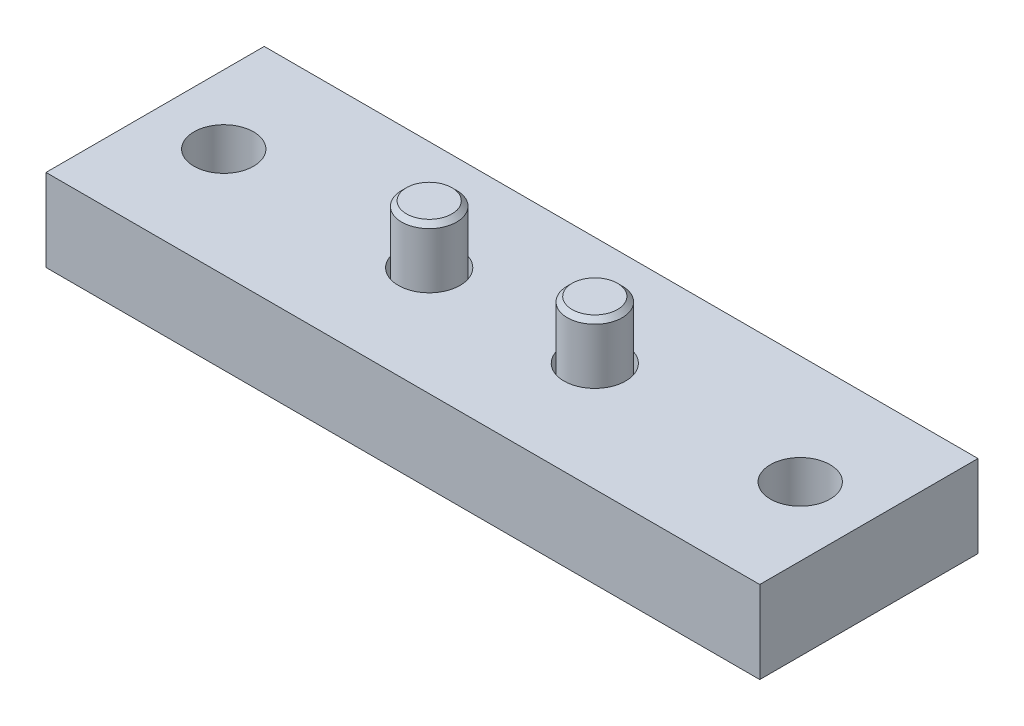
ISO-10303-21;
HEADER;
FILE_DESCRIPTION(('STEP AP214'),'2;1');
FILE_NAME('part.step','',(''),(''),'','','');
FILE_SCHEMA(('AUTOMOTIVE_DESIGN { 1 0 10303 214 1 1 1 1 }'));
ENDSEC;
DATA;
#1=APPLICATION_CONTEXT('core data for automotive mechanical design processes');
#2=APPLICATION_PROTOCOL_DEFINITION('international standard','automotive_design',2000,#1);
#3=PRODUCT_CONTEXT('',#1,'mechanical');
#4=PRODUCT('Part','Part','',(#3));
#5=PRODUCT_RELATED_PRODUCT_CATEGORY('part','',(#4));
#6=PRODUCT_DEFINITION_FORMATION('','',#4);
#7=PRODUCT_DEFINITION_CONTEXT('part definition',#1,'design');
#8=PRODUCT_DEFINITION('design','',#6,#7);
#9=PRODUCT_DEFINITION_SHAPE('','',#8);
#10=(LENGTH_UNIT() NAMED_UNIT(*) SI_UNIT(.MILLI.,.METRE.));
#11=(NAMED_UNIT(*) PLANE_ANGLE_UNIT() SI_UNIT($,.RADIAN.));
#12=(NAMED_UNIT(*) SI_UNIT($,.STERADIAN.) SOLID_ANGLE_UNIT());
#13=UNCERTAINTY_MEASURE_WITH_UNIT(LENGTH_MEASURE(1.E-05),#10,'distance_accuracy_value','');
#14=(GEOMETRIC_REPRESENTATION_CONTEXT(3) GLOBAL_UNCERTAINTY_ASSIGNED_CONTEXT((#13)) GLOBAL_UNIT_ASSIGNED_CONTEXT((#10,
#11,#12)) REPRESENTATION_CONTEXT('',''));
#15=CARTESIAN_POINT('',(0.,0.,0.));
#16=DIRECTION('',(0.,0.,1.));
#17=DIRECTION('',(1.,0.,0.));
#18=AXIS2_PLACEMENT_3D('',#15,#16,#17);
#19=CARTESIAN_POINT('',(8.7555,8.438,0.));
#20=DIRECTION('',(0.,1.,0.));
#21=DIRECTION('',(0.,0.,-1.));
#22=AXIS2_PLACEMENT_3D('',#19,#20,#21);
#23=PLANE('',#22);
#24=CARTESIAN_POINT('',(12.065,8.438,0.));
#25=DIRECTION('',(0.,-1.,0.));
#26=DIRECTION('',(0.,0.,1.));
#27=AXIS2_PLACEMENT_3D('',#24,#25,#26);
#28=CIRCLE('',#27,3.3095);
#29=CARTESIAN_POINT('',(12.065,8.438,3.3095));
#30=VERTEX_POINT('',#29);
#31=EDGE_CURVE('E915',#30,#30,#28,.T.);
#32=ORIENTED_EDGE('',*,*,#31,.F.);
#33=EDGE_LOOP('',(#32));
#34=FACE_BOUND('',#33,.T.);
#35=ADVANCED_FACE('F16',(#34),#23,.T.);
#36=CARTESIAN_POINT('',(12.065,8.438,0.));
#37=DIRECTION('',(0.,-1.,0.));
#38=DIRECTION('',(0.,0.,1.));
#39=AXIS2_PLACEMENT_3D('',#36,#37,#38);
#40=CONICAL_SURFACE('',#39,3.3095,0.785398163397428);
#41=CARTESIAN_POINT('',(12.065,7.7475,0.));
#42=DIRECTION('',(0.,-1.,0.));
#43=DIRECTION('',(0.,0.,1.));
#44=AXIS2_PLACEMENT_3D('',#41,#42,#43);
#45=CIRCLE('',#44,4.);
#46=CARTESIAN_POINT('',(12.065,7.7475,4.));
#47=VERTEX_POINT('',#46);
#48=EDGE_CURVE('E912',#47,#47,#45,.T.);
#49=ORIENTED_EDGE('',*,*,#48,.F.);
#50=EDGE_LOOP('',(#49));
#51=FACE_BOUND('',#50,.T.);
#52=ORIENTED_EDGE('',*,*,#31,.T.);
#53=EDGE_LOOP('',(#52));
#54=FACE_BOUND('',#53,.T.);
#55=ADVANCED_FACE('F328',(#51,#54),#40,.T.);
#56=CARTESIAN_POINT('',(12.065,-11.562,0.));
#57=DIRECTION('',(0.,-1.,0.));
#58=DIRECTION('',(0.,0.,1.));
#59=AXIS2_PLACEMENT_3D('',#56,#57,#58);
#60=CYLINDRICAL_SURFACE('',#59,4.);
#61=CARTESIAN_POINT('',(12.065,-6.43631457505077,0.));
#62=DIRECTION('',(0.,-1.,0.));
#63=DIRECTION('',(0.,0.,1.));
#64=AXIS2_PLACEMENT_3D('',#61,#62,#63);
#65=CIRCLE('',#64,4.);
#66=CARTESIAN_POINT('',(12.065,-6.43631457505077,4.));
#67=VERTEX_POINT('',#66);
#68=EDGE_CURVE('E26',#67,#67,#65,.F.);
#69=ORIENTED_EDGE('',*,*,#68,.T.);
#70=EDGE_LOOP('',(#69));
#71=FACE_BOUND('',#70,.T.);
#72=ORIENTED_EDGE('',*,*,#48,.T.);
#73=EDGE_LOOP('',(#72));
#74=FACE_BOUND('',#73,.T.);
#75=ADVANCED_FACE('F335',(#71,#74),#60,.T.);
#76=CARTESIAN_POINT('',(12.065,-6.43631457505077,0.));
#77=DIRECTION('',(0.,-1.,0.));
#78=DIRECTION('',(0.,0.,1.));
#79=AXIS2_PLACEMENT_3D('',#76,#77,#78);
#80=TOROIDAL_SURFACE('',#79,4.4,0.4);
#81=ORIENTED_EDGE('',*,*,#68,.F.);
#82=EDGE_LOOP('',(#81));
#83=FACE_BOUND('',#82,.T.);
#84=CARTESIAN_POINT('',(12.065,-6.71915728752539,0.));
#85=DIRECTION('',(0.,-1.,0.));
#86=DIRECTION('',(0.,0.,1.));
#87=AXIS2_PLACEMENT_3D('',#84,#85,#86);
#88=CIRCLE('',#87,4.11715728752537);
#89=CARTESIAN_POINT('',(12.065,-6.71915728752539,4.11715728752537));
#90=VERTEX_POINT('',#89);
#91=EDGE_CURVE('E903',#90,#90,#88,.T.);
#92=ORIENTED_EDGE('',*,*,#91,.F.);
#93=EDGE_LOOP('',(#92));
#94=FACE_BOUND('',#93,.T.);
#95=ADVANCED_FACE('F340',(#83,#94),#80,.F.);
#96=CARTESIAN_POINT('',(12.065,-10.352,0.));
#97=DIRECTION('',(0.,-1.,0.));
#98=DIRECTION('',(0.,0.,1.));
#99=AXIS2_PLACEMENT_3D('',#96,#97,#98);
#100=CONICAL_SURFACE('',#99,7.75,0.78539816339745);
#101=ORIENTED_EDGE('',*,*,#91,.T.);
#102=EDGE_LOOP('',(#101));
#103=FACE_BOUND('',#102,.T.);
#104=CARTESIAN_POINT('',(12.065,-7.097,0.));
#105=DIRECTION('',(0.,-1.,0.));
#106=DIRECTION('',(0.,0.,-1.));
#107=AXIS2_PLACEMENT_3D('',#104,#105,#106);
#108=CIRCLE('',#107,4.495);
#109=CARTESIAN_POINT('',(12.065,-7.097,-4.495));
#110=VERTEX_POINT('',#109);
#111=EDGE_CURVE('E10',#110,#110,#108,.F.);
#112=ORIENTED_EDGE('',*,*,#111,.T.);
#113=EDGE_LOOP('',(#112));
#114=FACE_BOUND('',#113,.T.);
#115=ADVANCED_FACE('F346',(#103,#114),#100,.T.);
#116=CARTESIAN_POINT('',(12.065,-11.562,0.));
#117=DIRECTION('',(0.,-1.,0.));
#118=DIRECTION('',(0.,0.,1.));
#119=AXIS2_PLACEMENT_3D('',#116,#117,#118);
#120=PLANE('',#119);
#121=CARTESIAN_POINT('',(12.065,-11.562,0.));
#122=DIRECTION('',(0.,-1.,0.));
#123=DIRECTION('',(0.,0.,1.));
#124=AXIS2_PLACEMENT_3D('',#121,#122,#123);
#125=CIRCLE('',#124,7.75);
#126=CARTESIAN_POINT('',(12.065,-11.562,7.75));
#127=VERTEX_POINT('',#126);
#128=EDGE_CURVE('E904',#127,#127,#125,.T.);
#129=ORIENTED_EDGE('',*,*,#128,.T.);
#130=EDGE_LOOP('',(#129));
#131=FACE_BOUND('',#130,.T.);
#132=DIRECTION('',(0.5,0.,-0.866025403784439));
#133=VECTOR('',#132,1.);
#134=CARTESIAN_POINT('',(13.5083756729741,-11.562,2.5));
#135=LINE('',#134,#133);
#136=CARTESIAN_POINT('',(13.5083756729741,-11.562,2.5));
#137=VERTEX_POINT('',#136);
#138=CARTESIAN_POINT('',(14.9517513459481,-11.562,0.));
#139=VERTEX_POINT('',#138);
#140=EDGE_CURVE('E962',#137,#139,#135,.T.);
#141=ORIENTED_EDGE('',*,*,#140,.T.);
#142=DIRECTION('',(-0.5,0.,-0.866025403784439));
#143=VECTOR('',#142,1.);
#144=CARTESIAN_POINT('',(14.9517513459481,-11.562,0.));
#145=LINE('',#144,#143);
#146=CARTESIAN_POINT('',(13.5083756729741,-11.562,-2.5));
#147=VERTEX_POINT('',#146);
#148=EDGE_CURVE('E35',#139,#147,#145,.T.);
#149=ORIENTED_EDGE('',*,*,#148,.T.);
#150=DIRECTION('',(-1.,0.,0.));
#151=VECTOR('',#150,1.);
#152=CARTESIAN_POINT('',(13.5083756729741,-11.562,-2.5));
#153=LINE('',#152,#151);
#154=CARTESIAN_POINT('',(10.6216243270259,-11.562,-2.5));
#155=VERTEX_POINT('',#154);
#156=EDGE_CURVE('E974',#147,#155,#153,.T.);
#157=ORIENTED_EDGE('',*,*,#156,.T.);
#158=DIRECTION('',(-0.5,0.,0.866025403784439));
#159=VECTOR('',#158,1.);
#160=CARTESIAN_POINT('',(10.6216243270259,-11.562,-2.5));
#161=LINE('',#160,#159);
#162=CARTESIAN_POINT('',(9.17824865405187,-11.562,0.));
#163=VERTEX_POINT('',#162);
#164=EDGE_CURVE('E971',#155,#163,#161,.T.);
#165=ORIENTED_EDGE('',*,*,#164,.T.);
#166=DIRECTION('',(0.5,0.,0.866025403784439));
#167=VECTOR('',#166,1.);
#168=CARTESIAN_POINT('',(9.17824865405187,-11.562,0.));
#169=LINE('',#168,#167);
#170=CARTESIAN_POINT('',(10.6216243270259,-11.562,2.5));
#171=VERTEX_POINT('',#170);
#172=EDGE_CURVE('E968',#163,#171,#169,.T.);
#173=ORIENTED_EDGE('',*,*,#172,.T.);
#174=DIRECTION('',(1.,0.,0.));
#175=VECTOR('',#174,1.);
#176=CARTESIAN_POINT('',(10.6216243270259,-11.562,2.5));
#177=LINE('',#176,#175);
#178=EDGE_CURVE('E965',#171,#137,#177,.T.);
#179=ORIENTED_EDGE('',*,*,#178,.T.);
#180=EDGE_LOOP('',(#141,#149,#157,#165,#173,#179));
#181=FACE_BOUND('',#180,.T.);
#182=ADVANCED_FACE('F349',(#131,#181),#120,.T.);
#183=CARTESIAN_POINT('',(12.065,-11.562,0.));
#184=DIRECTION('',(0.,-1.,0.));
#185=DIRECTION('',(0.,0.,1.));
#186=AXIS2_PLACEMENT_3D('',#183,#184,#185);
#187=CYLINDRICAL_SURFACE('',#186,7.75);
#188=CARTESIAN_POINT('',(12.065,-10.352,0.));
#189=DIRECTION('',(0.,-1.,0.));
#190=DIRECTION('',(0.,0.,1.));
#191=AXIS2_PLACEMENT_3D('',#188,#189,#190);
#192=CIRCLE('',#191,7.75);
#193=CARTESIAN_POINT('',(12.065,-10.352,7.75));
#194=VERTEX_POINT('',#193);
#195=EDGE_CURVE('E907',#194,#194,#192,.T.);
#196=ORIENTED_EDGE('',*,*,#195,.T.);
#197=EDGE_LOOP('',(#196));
#198=FACE_BOUND('',#197,.T.);
#199=ORIENTED_EDGE('',*,*,#128,.F.);
#200=EDGE_LOOP('',(#199));
#201=FACE_BOUND('',#200,.T.);
#202=ADVANCED_FACE('F352',(#198,#201),#187,.T.);
#203=CARTESIAN_POINT('',(14.9517513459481,-8.562,0.));
#204=DIRECTION('',(-0.866025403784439,0.,0.5));
#205=DIRECTION('',(0.5,0.,0.866025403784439));
#206=AXIS2_PLACEMENT_3D('',#203,#204,#205);
#207=PLANE('',#206);
#208=ORIENTED_EDGE('',*,*,#148,.F.);
#209=DIRECTION('',(0.,-1.,0.));
#210=VECTOR('',#209,1.);
#211=CARTESIAN_POINT('',(14.9517513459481,-8.562,0.));
#212=LINE('',#211,#210);
#213=CARTESIAN_POINT('',(14.9517513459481,-8.562,0.));
#214=VERTEX_POINT('',#213);
#215=EDGE_CURVE('E937',#214,#139,#212,.T.);
#216=ORIENTED_EDGE('',*,*,#215,.F.);
#217=DIRECTION('',(-0.5,0.,-0.866025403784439));
#218=VECTOR('',#217,1.);
#219=CARTESIAN_POINT('',(14.9517513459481,-8.562,0.));
#220=LINE('',#219,#218);
#221=CARTESIAN_POINT('',(14.2300635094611,-8.562,-1.25));
#222=VERTEX_POINT('',#221);
#223=EDGE_CURVE('E958',#214,#222,#220,.T.);
#224=ORIENTED_EDGE('',*,*,#223,.T.);
#225=CARTESIAN_POINT('',(13.5083756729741,-8.562,-2.5));
#226=VERTEX_POINT('',#225);
#227=EDGE_CURVE('E961',#222,#226,#220,.T.);
#228=ORIENTED_EDGE('',*,*,#227,.T.);
#229=DIRECTION('',(0.,-1.,0.));
#230=VECTOR('',#229,1.);
#231=CARTESIAN_POINT('',(13.5083756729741,-8.562,-2.5));
#232=LINE('',#231,#230);
#233=EDGE_CURVE('E923',#226,#147,#232,.T.);
#234=ORIENTED_EDGE('',*,*,#233,.T.);
#235=EDGE_LOOP('',(#208,#216,#224,#228,#234));
#236=FACE_BOUND('',#235,.T.);
#237=ADVANCED_FACE('F355',(#236),#207,.T.);
#238=CARTESIAN_POINT('',(13.5083756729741,-8.562,-2.5));
#239=DIRECTION('',(0.,0.,1.));
#240=DIRECTION('',(1.,0.,0.));
#241=AXIS2_PLACEMENT_3D('',#238,#239,#240);
#242=PLANE('',#241);
#243=ORIENTED_EDGE('',*,*,#156,.F.);
#244=ORIENTED_EDGE('',*,*,#233,.F.);
#245=DIRECTION('',(-1.,0.,0.));
#246=VECTOR('',#245,1.);
#247=CARTESIAN_POINT('',(13.5083756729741,-8.562,-2.5));
#248=LINE('',#247,#246);
#249=CARTESIAN_POINT('',(12.065,-8.562,-2.5));
#250=VERTEX_POINT('',#249);
#251=EDGE_CURVE('E955',#226,#250,#248,.T.);
#252=ORIENTED_EDGE('',*,*,#251,.T.);
#253=CARTESIAN_POINT('',(10.6216243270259,-8.562,-2.5));
#254=VERTEX_POINT('',#253);
#255=EDGE_CURVE('E957',#250,#254,#248,.T.);
#256=ORIENTED_EDGE('',*,*,#255,.T.);
#257=DIRECTION('',(0.,-1.,0.));
#258=VECTOR('',#257,1.);
#259=CARTESIAN_POINT('',(10.6216243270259,-8.562,-2.5));
#260=LINE('',#259,#258);
#261=EDGE_CURVE('E925',#254,#155,#260,.T.);
#262=ORIENTED_EDGE('',*,*,#261,.T.);
#263=EDGE_LOOP('',(#243,#244,#252,#256,#262));
#264=FACE_BOUND('',#263,.T.);
#265=ADVANCED_FACE('F778',(#264),#242,.T.);
#266=CARTESIAN_POINT('',(10.6216243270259,-8.562,-2.5));
#267=DIRECTION('',(0.866025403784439,0.,0.5));
#268=DIRECTION('',(0.5,0.,-0.866025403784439));
#269=AXIS2_PLACEMENT_3D('',#266,#267,#268);
#270=PLANE('',#269);
#271=ORIENTED_EDGE('',*,*,#164,.F.);
#272=ORIENTED_EDGE('',*,*,#261,.F.);
#273=DIRECTION('',(-0.5,0.,0.866025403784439));
#274=VECTOR('',#273,1.);
#275=CARTESIAN_POINT('',(10.6216243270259,-8.562,-2.5));
#276=LINE('',#275,#274);
#277=CARTESIAN_POINT('',(9.8999364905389,-8.562,-1.25));
#278=VERTEX_POINT('',#277);
#279=EDGE_CURVE('E951',#254,#278,#276,.T.);
#280=ORIENTED_EDGE('',*,*,#279,.T.);
#281=CARTESIAN_POINT('',(9.17824865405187,-8.562,0.));
#282=VERTEX_POINT('',#281);
#283=EDGE_CURVE('E954',#278,#282,#276,.T.);
#284=ORIENTED_EDGE('',*,*,#283,.T.);
#285=DIRECTION('',(0.,-1.,0.));
#286=VECTOR('',#285,1.);
#287=CARTESIAN_POINT('',(9.17824865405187,-8.562,0.));
#288=LINE('',#287,#286);
#289=EDGE_CURVE('E928',#282,#163,#288,.T.);
#290=ORIENTED_EDGE('',*,*,#289,.T.);
#291=EDGE_LOOP('',(#271,#272,#280,#284,#290));
#292=FACE_BOUND('',#291,.T.);
#293=ADVANCED_FACE('F768',(#292),#270,.T.);
#294=CARTESIAN_POINT('',(9.17824865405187,-8.562,0.));
#295=DIRECTION('',(0.866025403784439,0.,-0.5));
#296=DIRECTION('',(-0.5,0.,-0.866025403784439));
#297=AXIS2_PLACEMENT_3D('',#294,#295,#296);
#298=PLANE('',#297);
#299=ORIENTED_EDGE('',*,*,#172,.F.);
#300=ORIENTED_EDGE('',*,*,#289,.F.);
#301=DIRECTION('',(0.5,0.,0.866025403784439));
#302=VECTOR('',#301,1.);
#303=CARTESIAN_POINT('',(9.17824865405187,-8.562,0.));
#304=LINE('',#303,#302);
#305=CARTESIAN_POINT('',(9.8999364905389,-8.562,1.25));
#306=VERTEX_POINT('',#305);
#307=EDGE_CURVE('E947',#282,#306,#304,.T.);
#308=ORIENTED_EDGE('',*,*,#307,.T.);
#309=CARTESIAN_POINT('',(10.6216243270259,-8.562,2.5));
#310=VERTEX_POINT('',#309);
#311=EDGE_CURVE('E950',#306,#310,#304,.T.);
#312=ORIENTED_EDGE('',*,*,#311,.T.);
#313=DIRECTION('',(0.,-1.,0.));
#314=VECTOR('',#313,1.);
#315=CARTESIAN_POINT('',(10.6216243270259,-8.562,2.5));
#316=LINE('',#315,#314);
#317=EDGE_CURVE('E931',#310,#171,#316,.T.);
#318=ORIENTED_EDGE('',*,*,#317,.T.);
#319=EDGE_LOOP('',(#299,#300,#308,#312,#318));
#320=FACE_BOUND('',#319,.T.);
#321=ADVANCED_FACE('F758',(#320),#298,.T.);
#322=CARTESIAN_POINT('',(10.6216243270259,-8.562,2.5));
#323=DIRECTION('',(0.,0.,-1.));
#324=DIRECTION('',(0.,-1.,0.));
#325=AXIS2_PLACEMENT_3D('',#322,#323,#324);
#326=PLANE('',#325);
#327=ORIENTED_EDGE('',*,*,#178,.F.);
#328=ORIENTED_EDGE('',*,*,#317,.F.);
#329=DIRECTION('',(1.,0.,0.));
#330=VECTOR('',#329,1.);
#331=CARTESIAN_POINT('',(10.6216243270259,-8.562,2.5));
#332=LINE('',#331,#330);
#333=CARTESIAN_POINT('',(12.065,-8.562,2.5));
#334=VERTEX_POINT('',#333);
#335=EDGE_CURVE('E943',#310,#334,#332,.T.);
#336=ORIENTED_EDGE('',*,*,#335,.T.);
#337=CARTESIAN_POINT('',(13.5083756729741,-8.562,2.5));
#338=VERTEX_POINT('',#337);
#339=EDGE_CURVE('E946',#334,#338,#332,.T.);
#340=ORIENTED_EDGE('',*,*,#339,.T.);
#341=DIRECTION('',(0.,-1.,0.));
#342=VECTOR('',#341,1.);
#343=CARTESIAN_POINT('',(13.5083756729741,-8.562,2.5));
#344=LINE('',#343,#342);
#345=EDGE_CURVE('E934',#338,#137,#344,.T.);
#346=ORIENTED_EDGE('',*,*,#345,.T.);
#347=EDGE_LOOP('',(#327,#328,#336,#340,#346));
#348=FACE_BOUND('',#347,.T.);
#349=ADVANCED_FACE('F748',(#348),#326,.T.);
#350=CARTESIAN_POINT('',(13.5083756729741,-8.562,2.5));
#351=DIRECTION('',(-0.866025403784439,0.,-0.5));
#352=DIRECTION('',(-0.5,0.,0.866025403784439));
#353=AXIS2_PLACEMENT_3D('',#350,#351,#352);
#354=PLANE('',#353);
#355=ORIENTED_EDGE('',*,*,#140,.F.);
#356=ORIENTED_EDGE('',*,*,#345,.F.);
#357=DIRECTION('',(0.5,0.,-0.866025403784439));
#358=VECTOR('',#357,1.);
#359=CARTESIAN_POINT('',(13.5083756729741,-8.562,2.5));
#360=LINE('',#359,#358);
#361=CARTESIAN_POINT('',(14.2300635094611,-8.562,1.25));
#362=VERTEX_POINT('',#361);
#363=EDGE_CURVE('E939',#338,#362,#360,.T.);
#364=ORIENTED_EDGE('',*,*,#363,.T.);
#365=EDGE_CURVE('E942',#362,#214,#360,.T.);
#366=ORIENTED_EDGE('',*,*,#365,.T.);
#367=ORIENTED_EDGE('',*,*,#215,.T.);
#368=EDGE_LOOP('',(#355,#356,#364,#366,#367));
#369=FACE_BOUND('',#368,.T.);
#370=ADVANCED_FACE('F739',(#369),#354,.T.);
#371=CARTESIAN_POINT('',(13.5083756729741,-8.562,-2.5));
#372=DIRECTION('',(0.,1.,0.));
#373=DIRECTION('',(0.,0.,-1.));
#374=AXIS2_PLACEMENT_3D('',#371,#372,#373);
#375=PLANE('',#374);
#376=ORIENTED_EDGE('',*,*,#251,.F.);
#377=ORIENTED_EDGE('',*,*,#227,.F.);
#378=CARTESIAN_POINT('',(12.065,-8.562,0.));
#379=DIRECTION('',(0.,-1.,0.));
#380=DIRECTION('',(0.,0.,1.));
#381=AXIS2_PLACEMENT_3D('',#378,#379,#380);
#382=CIRCLE('',#381,2.5);
#383=EDGE_CURVE('E1049',#250,#222,#382,.T.);
#384=ORIENTED_EDGE('',*,*,#383,.F.);
#385=EDGE_LOOP('',(#376,#377,#384));
#386=FACE_BOUND('',#385,.T.);
#387=ADVANCED_FACE('F696',(#386),#375,.F.);
#388=ORIENTED_EDGE('',*,*,#223,.F.);
#389=ORIENTED_EDGE('',*,*,#365,.F.);
#390=EDGE_CURVE('E1050',#222,#362,#382,.T.);
#391=ORIENTED_EDGE('',*,*,#390,.F.);
#392=EDGE_LOOP('',(#388,#389,#391));
#393=FACE_BOUND('',#392,.T.);
#394=ADVANCED_FACE('F722',(#393),#375,.F.);
#395=ORIENTED_EDGE('',*,*,#363,.F.);
#396=ORIENTED_EDGE('',*,*,#339,.F.);
#397=EDGE_CURVE('E922',#362,#334,#382,.T.);
#398=ORIENTED_EDGE('',*,*,#397,.F.);
#399=EDGE_LOOP('',(#395,#396,#398));
#400=FACE_BOUND('',#399,.T.);
#401=ADVANCED_FACE('F713',(#400),#375,.F.);
#402=ORIENTED_EDGE('',*,*,#335,.F.);
#403=ORIENTED_EDGE('',*,*,#311,.F.);
#404=EDGE_CURVE('E918',#334,#306,#382,.T.);
#405=ORIENTED_EDGE('',*,*,#404,.F.);
#406=EDGE_LOOP('',(#402,#403,#405));
#407=FACE_BOUND('',#406,.T.);
#408=ADVANCED_FACE('F704',(#407),#375,.F.);
#409=ORIENTED_EDGE('',*,*,#307,.F.);
#410=ORIENTED_EDGE('',*,*,#283,.F.);
#411=EDGE_CURVE('E921',#306,#278,#382,.T.);
#412=ORIENTED_EDGE('',*,*,#411,.F.);
#413=EDGE_LOOP('',(#409,#410,#412));
#414=FACE_BOUND('',#413,.T.);
#415=ADVANCED_FACE('F693',(#414),#375,.F.);
#416=ORIENTED_EDGE('',*,*,#279,.F.);
#417=ORIENTED_EDGE('',*,*,#255,.F.);
#418=EDGE_CURVE('E1045',#278,#250,#382,.T.);
#419=ORIENTED_EDGE('',*,*,#418,.F.);
#420=EDGE_LOOP('',(#416,#417,#419));
#421=FACE_BOUND('',#420,.T.);
#422=ADVANCED_FACE('F684',(#421),#375,.F.);
#423=CARTESIAN_POINT('',(12.065,-8.562,0.));
#424=DIRECTION('',(0.,-1.,0.));
#425=DIRECTION('',(0.,0.,1.));
#426=AXIS2_PLACEMENT_3D('',#423,#424,#425);
#427=CONICAL_SURFACE('',#426,2.5,1.0471975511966);
#428=CARTESIAN_POINT('',(12.065,-7.11862432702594,0.));
#429=VERTEX_POINT('',#428);
#430=VERTEX_LOOP('',#429);
#431=FACE_BOUND('',#430,.T.);
#432=ORIENTED_EDGE('',*,*,#404,.T.);
#433=ORIENTED_EDGE('',*,*,#411,.T.);
#434=ORIENTED_EDGE('',*,*,#418,.T.);
#435=ORIENTED_EDGE('',*,*,#383,.T.);
#436=ORIENTED_EDGE('',*,*,#390,.T.);
#437=ORIENTED_EDGE('',*,*,#397,.T.);
#438=EDGE_LOOP('',(#432,#433,#434,#435,#436,#437));
#439=FACE_BOUND('',#438,.T.);
#440=ADVANCED_FACE('F674',(#431,#439),#427,.F.);
#441=CARTESIAN_POINT('',(-12.065,-8.562,0.));
#442=DIRECTION('',(0.,-1.,0.));
#443=DIRECTION('',(0.,0.,1.));
#444=AXIS2_PLACEMENT_3D('',#441,#442,#443);
#445=CONICAL_SURFACE('',#444,2.5,1.0471975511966);
#446=CARTESIAN_POINT('',(-12.065,-7.11862432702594,0.));
#447=VERTEX_POINT('',#446);
#448=VERTEX_LOOP('',#447);
#449=FACE_BOUND('',#448,.T.);
#450=CARTESIAN_POINT('',(-12.065,-8.562,0.));
#451=DIRECTION('',(0.,-1.,0.));
#452=DIRECTION('',(0.,0.,1.));
#453=AXIS2_PLACEMENT_3D('',#450,#451,#452);
#454=CIRCLE('',#453,2.5);
#455=CARTESIAN_POINT('',(-12.065,-8.562,2.5));
#456=VERTEX_POINT('',#455);
#457=CARTESIAN_POINT('',(-14.2300635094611,-8.562,1.25));
#458=VERTEX_POINT('',#457);
#459=EDGE_CURVE('E190',#456,#458,#454,.T.);
#460=ORIENTED_EDGE('',*,*,#459,.T.);
#461=CARTESIAN_POINT('',(-14.2300635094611,-8.562,-1.25));
#462=VERTEX_POINT('',#461);
#463=EDGE_CURVE('E194',#458,#462,#454,.T.);
#464=ORIENTED_EDGE('',*,*,#463,.T.);
#465=CARTESIAN_POINT('',(-12.065,-8.562,-2.5));
#466=VERTEX_POINT('',#465);
#467=EDGE_CURVE('E310',#462,#466,#454,.T.);
#468=ORIENTED_EDGE('',*,*,#467,.T.);
#469=CARTESIAN_POINT('',(-9.89993649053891,-8.562,-1.25));
#470=VERTEX_POINT('',#469);
#471=EDGE_CURVE('E307',#466,#470,#454,.T.);
#472=ORIENTED_EDGE('',*,*,#471,.T.);
#473=CARTESIAN_POINT('',(-9.89993649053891,-8.562,1.25));
#474=VERTEX_POINT('',#473);
#475=EDGE_CURVE('E305',#470,#474,#454,.T.);
#476=ORIENTED_EDGE('',*,*,#475,.T.);
#477=EDGE_CURVE('E189',#474,#456,#454,.T.);
#478=ORIENTED_EDGE('',*,*,#477,.T.);
#479=EDGE_LOOP('',(#460,#464,#468,#472,#476,#478));
#480=FACE_BOUND('',#479,.T.);
#481=ADVANCED_FACE('F292',(#449,#480),#445,.F.);
#482=CARTESIAN_POINT('',(-15.3745,8.438,0.));
#483=DIRECTION('',(0.,1.,0.));
#484=DIRECTION('',(0.,0.,-1.));
#485=AXIS2_PLACEMENT_3D('',#482,#483,#484);
#486=PLANE('',#485);
#487=CARTESIAN_POINT('',(-12.065,8.438,0.));
#488=DIRECTION('',(0.,-1.,0.));
#489=DIRECTION('',(0.,0.,1.));
#490=AXIS2_PLACEMENT_3D('',#487,#488,#489);
#491=CIRCLE('',#490,3.3095);
#492=CARTESIAN_POINT('',(-12.065,8.438,3.3095));
#493=VERTEX_POINT('',#492);
#494=EDGE_CURVE('E193',#493,#493,#491,.T.);
#495=ORIENTED_EDGE('',*,*,#494,.F.);
#496=EDGE_LOOP('',(#495));
#497=FACE_BOUND('',#496,.T.);
#498=ADVANCED_FACE('F545',(#497),#486,.T.);
#499=CARTESIAN_POINT('',(-10.6216243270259,-8.562,-2.5));
#500=DIRECTION('',(0.,1.,0.));
#501=DIRECTION('',(0.,0.,-1.));
#502=AXIS2_PLACEMENT_3D('',#499,#500,#501);
#503=PLANE('',#502);
#504=DIRECTION('',(1.,0.,0.));
#505=VECTOR('',#504,1.);
#506=CARTESIAN_POINT('',(-13.5083756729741,-8.562,2.5));
#507=LINE('',#506,#505);
#508=CARTESIAN_POINT('',(-13.5083756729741,-8.562,2.5));
#509=VERTEX_POINT('',#508);
#510=EDGE_CURVE('E174',#509,#456,#507,.T.);
#511=ORIENTED_EDGE('',*,*,#510,.F.);
#512=DIRECTION('',(0.5,0.,0.866025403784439));
#513=VECTOR('',#512,1.);
#514=CARTESIAN_POINT('',(-14.9517513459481,-8.562,0.));
#515=LINE('',#514,#513);
#516=EDGE_CURVE('E169',#458,#509,#515,.T.);
#517=ORIENTED_EDGE('',*,*,#516,.F.);
#518=ORIENTED_EDGE('',*,*,#459,.F.);
#519=EDGE_LOOP('',(#511,#517,#518));
#520=FACE_BOUND('',#519,.T.);
#521=ADVANCED_FACE('F298',(#520),#503,.F.);
#522=CARTESIAN_POINT('',(-14.9517513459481,-8.562,0.));
#523=VERTEX_POINT('',#522);
#524=EDGE_CURVE('E170',#523,#458,#515,.T.);
#525=ORIENTED_EDGE('',*,*,#524,.F.);
#526=DIRECTION('',(-0.5,0.,0.866025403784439));
#527=VECTOR('',#526,1.);
#528=CARTESIAN_POINT('',(-13.5083756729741,-8.562,-2.5));
#529=LINE('',#528,#527);
#530=EDGE_CURVE('E165',#462,#523,#529,.T.);
#531=ORIENTED_EDGE('',*,*,#530,.F.);
#532=ORIENTED_EDGE('',*,*,#463,.F.);
#533=EDGE_LOOP('',(#525,#531,#532));
#534=FACE_BOUND('',#533,.T.);
#535=ADVANCED_FACE('F288',(#534),#503,.F.);
#536=CARTESIAN_POINT('',(-13.5083756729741,-8.562,-2.5));
#537=VERTEX_POINT('',#536);
#538=EDGE_CURVE('E166',#537,#462,#529,.T.);
#539=ORIENTED_EDGE('',*,*,#538,.F.);
#540=DIRECTION('',(-1.,0.,0.));
#541=VECTOR('',#540,1.);
#542=CARTESIAN_POINT('',(-10.6216243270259,-8.562,-2.5));
#543=LINE('',#542,#541);
#544=EDGE_CURVE('E163',#466,#537,#543,.T.);
#545=ORIENTED_EDGE('',*,*,#544,.F.);
#546=ORIENTED_EDGE('',*,*,#467,.F.);
#547=EDGE_LOOP('',(#539,#545,#546));
#548=FACE_BOUND('',#547,.T.);
#549=ADVANCED_FACE('F312',(#548),#503,.F.);
#550=CARTESIAN_POINT('',(-10.6216243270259,-8.562,-2.5));
#551=VERTEX_POINT('',#550);
#552=EDGE_CURVE('E122',#551,#466,#543,.T.);
#553=ORIENTED_EDGE('',*,*,#552,.F.);
#554=DIRECTION('',(-0.5,0.,-0.866025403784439));
#555=VECTOR('',#554,1.);
#556=CARTESIAN_POINT('',(-9.17824865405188,-8.562,0.));
#557=LINE('',#556,#555);
#558=EDGE_CURVE('E155',#470,#551,#557,.T.);
#559=ORIENTED_EDGE('',*,*,#558,.F.);
#560=ORIENTED_EDGE('',*,*,#471,.F.);
#561=EDGE_LOOP('',(#553,#559,#560));
#562=FACE_BOUND('',#561,.T.);
#563=ADVANCED_FACE('F314',(#562),#503,.F.);
#564=CARTESIAN_POINT('',(-9.17824865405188,-8.562,0.));
#565=VERTEX_POINT('',#564);
#566=EDGE_CURVE('E157',#565,#470,#557,.T.);
#567=ORIENTED_EDGE('',*,*,#566,.F.);
#568=DIRECTION('',(0.5,0.,-0.866025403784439));
#569=VECTOR('',#568,1.);
#570=CARTESIAN_POINT('',(-10.6216243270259,-8.562,2.5));
#571=LINE('',#570,#569);
#572=EDGE_CURVE('E148',#474,#565,#571,.T.);
#573=ORIENTED_EDGE('',*,*,#572,.F.);
#574=ORIENTED_EDGE('',*,*,#475,.F.);
#575=EDGE_LOOP('',(#567,#573,#574));
#576=FACE_BOUND('',#575,.T.);
#577=ADVANCED_FACE('F315',(#576),#503,.F.);
#578=CARTESIAN_POINT('',(-10.6216243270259,-8.562,2.5));
#579=VERTEX_POINT('',#578);
#580=EDGE_CURVE('E150',#579,#474,#571,.T.);
#581=ORIENTED_EDGE('',*,*,#580,.F.);
#582=EDGE_CURVE('E173',#456,#579,#507,.T.);
#583=ORIENTED_EDGE('',*,*,#582,.F.);
#584=ORIENTED_EDGE('',*,*,#477,.F.);
#585=EDGE_LOOP('',(#581,#583,#584));
#586=FACE_BOUND('',#585,.T.);
#587=ADVANCED_FACE('F301',(#586),#503,.F.);
#588=CARTESIAN_POINT('',(-12.065,8.438,0.));
#589=DIRECTION('',(0.,-1.,0.));
#590=DIRECTION('',(0.,0.,1.));
#591=AXIS2_PLACEMENT_3D('',#588,#589,#590);
#592=CONICAL_SURFACE('',#591,3.3095,0.785398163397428);
#593=CARTESIAN_POINT('',(-12.065,7.7475,0.));
#594=DIRECTION('',(0.,-1.,0.));
#595=DIRECTION('',(0.,0.,1.));
#596=AXIS2_PLACEMENT_3D('',#593,#594,#595);
#597=CIRCLE('',#596,4.);
#598=CARTESIAN_POINT('',(-12.065,7.7475,4.));
#599=VERTEX_POINT('',#598);
#600=EDGE_CURVE('E197',#599,#599,#597,.T.);
#601=ORIENTED_EDGE('',*,*,#600,.F.);
#602=EDGE_LOOP('',(#601));
#603=FACE_BOUND('',#602,.T.);
#604=ORIENTED_EDGE('',*,*,#494,.T.);
#605=EDGE_LOOP('',(#604));
#606=FACE_BOUND('',#605,.T.);
#607=ADVANCED_FACE('F324',(#603,#606),#592,.T.);
#608=CARTESIAN_POINT('',(-13.5083756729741,-8.562,2.5));
#609=DIRECTION('',(0.,0.,-1.));
#610=DIRECTION('',(0.,-1.,0.));
#611=AXIS2_PLACEMENT_3D('',#608,#609,#610);
#612=PLANE('',#611);
#613=DIRECTION('',(1.,0.,0.));
#614=VECTOR('',#613,1.);
#615=CARTESIAN_POINT('',(-13.5083756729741,-11.562,2.5));
#616=LINE('',#615,#614);
#617=CARTESIAN_POINT('',(-13.5083756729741,-11.562,2.5));
#618=VERTEX_POINT('',#617);
#619=CARTESIAN_POINT('',(-10.6216243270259,-11.562,2.5));
#620=VERTEX_POINT('',#619);
#621=EDGE_CURVE('E154',#618,#620,#616,.T.);
#622=ORIENTED_EDGE('',*,*,#621,.F.);
#623=DIRECTION('',(0.,-1.,0.));
#624=VECTOR('',#623,1.);
#625=CARTESIAN_POINT('',(-13.5083756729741,-8.562,2.5));
#626=LINE('',#625,#624);
#627=EDGE_CURVE('E179',#509,#618,#626,.T.);
#628=ORIENTED_EDGE('',*,*,#627,.F.);
#629=ORIENTED_EDGE('',*,*,#510,.T.);
#630=ORIENTED_EDGE('',*,*,#582,.T.);
#631=DIRECTION('',(0.,-1.,0.));
#632=VECTOR('',#631,1.);
#633=CARTESIAN_POINT('',(-10.6216243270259,-8.562,2.5));
#634=LINE('',#633,#632);
#635=EDGE_CURVE('E149',#579,#620,#634,.T.);
#636=ORIENTED_EDGE('',*,*,#635,.T.);
#637=EDGE_LOOP('',(#622,#628,#629,#630,#636));
#638=FACE_BOUND('',#637,.T.);
#639=ADVANCED_FACE('F303',(#638),#612,.T.);
#640=CARTESIAN_POINT('',(-14.9517513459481,-8.562,0.));
#641=DIRECTION('',(0.866025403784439,0.,-0.5));
#642=DIRECTION('',(-0.5,0.,-0.866025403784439));
#643=AXIS2_PLACEMENT_3D('',#640,#641,#642);
#644=PLANE('',#643);
#645=DIRECTION('',(0.5,0.,0.866025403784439));
#646=VECTOR('',#645,1.);
#647=CARTESIAN_POINT('',(-14.9517513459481,-11.562,0.));
#648=LINE('',#647,#646);
#649=CARTESIAN_POINT('',(-14.9517513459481,-11.562,0.));
#650=VERTEX_POINT('',#649);
#651=EDGE_CURVE('E159',#650,#618,#648,.T.);
#652=ORIENTED_EDGE('',*,*,#651,.F.);
#653=DIRECTION('',(0.,-1.,0.));
#654=VECTOR('',#653,1.);
#655=CARTESIAN_POINT('',(-14.9517513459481,-8.562,0.));
#656=LINE('',#655,#654);
#657=EDGE_CURVE('E182',#523,#650,#656,.T.);
#658=ORIENTED_EDGE('',*,*,#657,.F.);
#659=ORIENTED_EDGE('',*,*,#524,.T.);
#660=ORIENTED_EDGE('',*,*,#516,.T.);
#661=ORIENTED_EDGE('',*,*,#627,.T.);
#662=EDGE_LOOP('',(#652,#658,#659,#660,#661));
#663=FACE_BOUND('',#662,.T.);
#664=ADVANCED_FACE('F278',(#663),#644,.T.);
#665=CARTESIAN_POINT('',(-13.5083756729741,-8.562,-2.5));
#666=DIRECTION('',(0.866025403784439,0.,0.5));
#667=DIRECTION('',(0.5,0.,-0.866025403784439));
#668=AXIS2_PLACEMENT_3D('',#665,#666,#667);
#669=PLANE('',#668);
#670=DIRECTION('',(-0.5,0.,0.866025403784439));
#671=VECTOR('',#670,1.);
#672=CARTESIAN_POINT('',(-13.5083756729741,-11.562,-2.5));
#673=LINE('',#672,#671);
#674=CARTESIAN_POINT('',(-13.5083756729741,-11.562,-2.5));
#675=VERTEX_POINT('',#674);
#676=EDGE_CURVE('E274',#675,#650,#673,.T.);
#677=ORIENTED_EDGE('',*,*,#676,.F.);
#678=DIRECTION('',(0.,-1.,0.));
#679=VECTOR('',#678,1.);
#680=CARTESIAN_POINT('',(-13.5083756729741,-8.562,-2.5));
#681=LINE('',#680,#679);
#682=EDGE_CURVE('E185',#537,#675,#681,.T.);
#683=ORIENTED_EDGE('',*,*,#682,.F.);
#684=ORIENTED_EDGE('',*,*,#538,.T.);
#685=ORIENTED_EDGE('',*,*,#530,.T.);
#686=ORIENTED_EDGE('',*,*,#657,.T.);
#687=EDGE_LOOP('',(#677,#683,#684,#685,#686));
#688=FACE_BOUND('',#687,.T.);
#689=ADVANCED_FACE('F282',(#688),#669,.T.);
#690=CARTESIAN_POINT('',(-10.6216243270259,-8.562,-2.5));
#691=DIRECTION('',(0.,0.,1.));
#692=DIRECTION('',(1.,0.,0.));
#693=AXIS2_PLACEMENT_3D('',#690,#691,#692);
#694=PLANE('',#693);
#695=DIRECTION('',(-1.,0.,0.));
#696=VECTOR('',#695,1.);
#697=CARTESIAN_POINT('',(-10.6216243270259,-11.562,-2.5));
#698=LINE('',#697,#696);
#699=CARTESIAN_POINT('',(-10.6216243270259,-11.562,-2.5));
#700=VERTEX_POINT('',#699);
#701=EDGE_CURVE('E139',#700,#675,#698,.T.);
#702=ORIENTED_EDGE('',*,*,#701,.F.);
#703=DIRECTION('',(0.,-1.,0.));
#704=VECTOR('',#703,1.);
#705=CARTESIAN_POINT('',(-10.6216243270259,-8.562,-2.5));
#706=LINE('',#705,#704);
#707=EDGE_CURVE('E135',#551,#700,#706,.T.);
#708=ORIENTED_EDGE('',*,*,#707,.F.);
#709=ORIENTED_EDGE('',*,*,#552,.T.);
#710=ORIENTED_EDGE('',*,*,#544,.T.);
#711=ORIENTED_EDGE('',*,*,#682,.T.);
#712=EDGE_LOOP('',(#702,#708,#709,#710,#711));
#713=FACE_BOUND('',#712,.T.);
#714=ADVANCED_FACE('F577',(#713),#694,.T.);
#715=CARTESIAN_POINT('',(-9.17824865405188,-8.562,0.));
#716=DIRECTION('',(-0.866025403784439,0.,0.5));
#717=DIRECTION('',(0.5,0.,0.866025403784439));
#718=AXIS2_PLACEMENT_3D('',#715,#716,#717);
#719=PLANE('',#718);
#720=DIRECTION('',(-0.5,0.,-0.866025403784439));
#721=VECTOR('',#720,1.);
#722=CARTESIAN_POINT('',(-9.17824865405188,-11.562,0.));
#723=LINE('',#722,#721);
#724=CARTESIAN_POINT('',(-9.17824865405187,-11.562,0.));
#725=VERTEX_POINT('',#724);
#726=EDGE_CURVE('E129',#725,#700,#723,.T.);
#727=ORIENTED_EDGE('',*,*,#726,.F.);
#728=DIRECTION('',(0.,-1.,0.));
#729=VECTOR('',#728,1.);
#730=CARTESIAN_POINT('',(-9.17824865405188,-8.562,0.));
#731=LINE('',#730,#729);
#732=EDGE_CURVE('E133',#565,#725,#731,.T.);
#733=ORIENTED_EDGE('',*,*,#732,.F.);
#734=ORIENTED_EDGE('',*,*,#566,.T.);
#735=ORIENTED_EDGE('',*,*,#558,.T.);
#736=ORIENTED_EDGE('',*,*,#707,.T.);
#737=EDGE_LOOP('',(#727,#733,#734,#735,#736));
#738=FACE_BOUND('',#737,.T.);
#739=ADVANCED_FACE('F131',(#738),#719,.T.);
#740=CARTESIAN_POINT('',(-10.6216243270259,-8.562,2.5));
#741=DIRECTION('',(-0.866025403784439,0.,-0.5));
#742=DIRECTION('',(-0.5,0.,0.866025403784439));
#743=AXIS2_PLACEMENT_3D('',#740,#741,#742);
#744=PLANE('',#743);
#745=DIRECTION('',(0.5,0.,-0.866025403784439));
#746=VECTOR('',#745,1.);
#747=CARTESIAN_POINT('',(-10.6216243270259,-11.562,2.5));
#748=LINE('',#747,#746);
#749=EDGE_CURVE('E144',#620,#725,#748,.T.);
#750=ORIENTED_EDGE('',*,*,#749,.F.);
#751=ORIENTED_EDGE('',*,*,#635,.F.);
#752=ORIENTED_EDGE('',*,*,#580,.T.);
#753=ORIENTED_EDGE('',*,*,#572,.T.);
#754=ORIENTED_EDGE('',*,*,#732,.T.);
#755=EDGE_LOOP('',(#750,#751,#752,#753,#754));
#756=FACE_BOUND('',#755,.T.);
#757=ADVANCED_FACE('F142',(#756),#744,.T.);
#758=CARTESIAN_POINT('',(-12.065,-11.562,0.));
#759=DIRECTION('',(0.,-1.,0.));
#760=DIRECTION('',(0.,0.,1.));
#761=AXIS2_PLACEMENT_3D('',#758,#759,#760);
#762=CYLINDRICAL_SURFACE('',#761,4.);
#763=CARTESIAN_POINT('',(-12.065,-6.43631457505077,0.));
#764=DIRECTION('',(0.,-1.,0.));
#765=DIRECTION('',(0.,0.,1.));
#766=AXIS2_PLACEMENT_3D('',#763,#764,#765);
#767=CIRCLE('',#766,4.);
#768=CARTESIAN_POINT('',(-12.065,-6.43631457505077,4.));
#769=VERTEX_POINT('',#768);
#770=EDGE_CURVE('E20',#769,#769,#767,.F.);
#771=ORIENTED_EDGE('',*,*,#770,.T.);
#772=EDGE_LOOP('',(#771));
#773=FACE_BOUND('',#772,.T.);
#774=ORIENTED_EDGE('',*,*,#600,.T.);
#775=EDGE_LOOP('',(#774));
#776=FACE_BOUND('',#775,.T.);
#777=ADVANCED_FACE('F527',(#773,#776),#762,.T.);
#778=CARTESIAN_POINT('',(-12.065,-11.562,0.));
#779=DIRECTION('',(0.,-1.,0.));
#780=DIRECTION('',(0.,0.,1.));
#781=AXIS2_PLACEMENT_3D('',#778,#779,#780);
#782=PLANE('',#781);
#783=CARTESIAN_POINT('',(-12.065,-11.562,0.));
#784=DIRECTION('',(0.,-1.,0.));
#785=DIRECTION('',(0.,0.,1.));
#786=AXIS2_PLACEMENT_3D('',#783,#784,#785);
#787=CIRCLE('',#786,7.75);
#788=CARTESIAN_POINT('',(-12.065,-11.562,7.75));
#789=VERTEX_POINT('',#788);
#790=EDGE_CURVE('E200',#789,#789,#787,.T.);
#791=ORIENTED_EDGE('',*,*,#790,.T.);
#792=EDGE_LOOP('',(#791));
#793=FACE_BOUND('',#792,.T.);
#794=ORIENTED_EDGE('',*,*,#749,.T.);
#795=ORIENTED_EDGE('',*,*,#726,.T.);
#796=ORIENTED_EDGE('',*,*,#701,.T.);
#797=ORIENTED_EDGE('',*,*,#676,.T.);
#798=ORIENTED_EDGE('',*,*,#651,.T.);
#799=ORIENTED_EDGE('',*,*,#621,.T.);
#800=EDGE_LOOP('',(#794,#795,#796,#797,#798,#799));
#801=FACE_BOUND('',#800,.T.);
#802=ADVANCED_FACE('F18',(#793,#801),#782,.T.);
#803=CARTESIAN_POINT('',(-12.065,-6.43631457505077,0.));
#804=DIRECTION('',(0.,-1.,0.));
#805=DIRECTION('',(0.,0.,1.));
#806=AXIS2_PLACEMENT_3D('',#803,#804,#805);
#807=TOROIDAL_SURFACE('',#806,4.4,0.4);
#808=ORIENTED_EDGE('',*,*,#770,.F.);
#809=EDGE_LOOP('',(#808));
#810=FACE_BOUND('',#809,.T.);
#811=CARTESIAN_POINT('',(-12.065,-6.71915728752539,0.));
#812=DIRECTION('',(0.,-1.,0.));
#813=DIRECTION('',(0.,0.,1.));
#814=AXIS2_PLACEMENT_3D('',#811,#812,#813);
#815=CIRCLE('',#814,4.11715728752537);
#816=CARTESIAN_POINT('',(-12.065,-6.71915728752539,4.11715728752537));
#817=VERTEX_POINT('',#816);
#818=EDGE_CURVE('E202',#817,#817,#815,.T.);
#819=ORIENTED_EDGE('',*,*,#818,.F.);
#820=EDGE_LOOP('',(#819));
#821=FACE_BOUND('',#820,.T.);
#822=ADVANCED_FACE('F388',(#810,#821),#807,.F.);
#823=CARTESIAN_POINT('',(-12.065,-11.562,0.));
#824=DIRECTION('',(0.,-1.,0.));
#825=DIRECTION('',(0.,0.,1.));
#826=AXIS2_PLACEMENT_3D('',#823,#824,#825);
#827=CYLINDRICAL_SURFACE('',#826,7.75);
#828=CARTESIAN_POINT('',(-12.065,-10.352,0.));
#829=DIRECTION('',(0.,-1.,0.));
#830=DIRECTION('',(0.,0.,-1.));
#831=AXIS2_PLACEMENT_3D('',#828,#829,#830);
#832=CIRCLE('',#831,7.75);
#833=CARTESIAN_POINT('',(-12.065,-10.352,-7.75));
#834=VERTEX_POINT('',#833);
#835=EDGE_CURVE('E270',#834,#834,#832,.F.);
#836=ORIENTED_EDGE('',*,*,#835,.F.);
#837=EDGE_LOOP('',(#836));
#838=FACE_BOUND('',#837,.T.);
#839=ORIENTED_EDGE('',*,*,#790,.F.);
#840=EDGE_LOOP('',(#839));
#841=FACE_BOUND('',#840,.T.);
#842=ADVANCED_FACE('F525',(#838,#841),#827,.T.);
#843=CARTESIAN_POINT('',(-12.065,-10.352,0.));
#844=DIRECTION('',(0.,-1.,0.));
#845=DIRECTION('',(0.,0.,1.));
#846=AXIS2_PLACEMENT_3D('',#843,#844,#845);
#847=CONICAL_SURFACE('',#846,7.75,0.78539816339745);
#848=ORIENTED_EDGE('',*,*,#818,.T.);
#849=EDGE_LOOP('',(#848));
#850=FACE_BOUND('',#849,.T.);
#851=CARTESIAN_POINT('',(-12.065,-7.097,0.));
#852=DIRECTION('',(0.,-1.,0.));
#853=DIRECTION('',(0.,0.,1.));
#854=AXIS2_PLACEMENT_3D('',#851,#852,#853);
#855=CIRCLE('',#854,4.495);
#856=CARTESIAN_POINT('',(-12.065,-7.097,4.495));
#857=VERTEX_POINT('',#856);
#858=EDGE_CURVE('E231',#857,#857,#855,.T.);
#859=ORIENTED_EDGE('',*,*,#858,.F.);
#860=EDGE_LOOP('',(#859));
#861=FACE_BOUND('',#860,.T.);
#862=ADVANCED_FACE('F386',(#850,#861),#847,.T.);
#863=CARTESIAN_POINT('',(-12.065,-12.,0.));
#864=DIRECTION('',(0.,-1.,0.));
#865=DIRECTION('',(0.,0.,1.));
#866=AXIS2_PLACEMENT_3D('',#863,#864,#865);
#867=CONICAL_SURFACE('',#866,9.398,0.78539816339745);
#868=ORIENTED_EDGE('',*,*,#835,.T.);
#869=EDGE_LOOP('',(#868));
#870=FACE_BOUND('',#869,.T.);
#871=CARTESIAN_POINT('',(-12.065,-12.,0.));
#872=DIRECTION('',(0.,-1.,0.));
#873=DIRECTION('',(0.,0.,1.));
#874=AXIS2_PLACEMENT_3D('',#871,#872,#873);
#875=CIRCLE('',#874,9.398);
#876=CARTESIAN_POINT('',(-12.065,-12.,9.398));
#877=VERTEX_POINT('',#876);
#878=EDGE_CURVE('E234',#877,#877,#875,.T.);
#879=ORIENTED_EDGE('',*,*,#878,.T.);
#880=EDGE_LOOP('',(#879));
#881=FACE_BOUND('',#880,.T.);
#882=ADVANCED_FACE('F383',(#870,#881),#867,.F.);
#883=CARTESIAN_POINT('',(52.,-12.,15.9));
#884=DIRECTION('',(0.,0.,-1.));
#885=DIRECTION('',(1.,0.,0.));
#886=AXIS2_PLACEMENT_3D('',#883,#884,#885);
#887=PLANE('',#886);
#888=DIRECTION('',(-1.,0.,0.));
#889=VECTOR('',#888,1.);
#890=CARTESIAN_POINT('',(52.,0.,15.9));
#891=LINE('',#890,#889);
#892=CARTESIAN_POINT('',(52.,0.,15.9));
#893=VERTEX_POINT('',#892);
#894=CARTESIAN_POINT('',(-52.,0.,15.9));
#895=VERTEX_POINT('',#894);
#896=EDGE_CURVE('E254',#893,#895,#891,.T.);
#897=ORIENTED_EDGE('',*,*,#896,.T.);
#898=DIRECTION('',(0.,1.,0.));
#899=VECTOR('',#898,1.);
#900=CARTESIAN_POINT('',(-52.,-12.,15.9));
#901=LINE('',#900,#899);
#902=CARTESIAN_POINT('',(-52.,-12.,15.9));
#903=VERTEX_POINT('',#902);
#904=EDGE_CURVE('E264',#903,#895,#901,.T.);
#905=ORIENTED_EDGE('',*,*,#904,.F.);
#906=DIRECTION('',(-1.,0.,0.));
#907=VECTOR('',#906,1.);
#908=CARTESIAN_POINT('',(52.,-12.,15.9));
#909=LINE('',#908,#907);
#910=CARTESIAN_POINT('',(52.,-12.,15.9));
#911=VERTEX_POINT('',#910);
#912=EDGE_CURVE('E244',#911,#903,#909,.T.);
#913=ORIENTED_EDGE('',*,*,#912,.F.);
#914=DIRECTION('',(0.,1.,0.));
#915=VECTOR('',#914,1.);
#916=CARTESIAN_POINT('',(52.,-12.,15.9));
#917=LINE('',#916,#915);
#918=EDGE_CURVE('E267',#911,#893,#917,.T.);
#919=ORIENTED_EDGE('',*,*,#918,.T.);
#920=EDGE_LOOP('',(#897,#905,#913,#919));
#921=FACE_BOUND('',#920,.T.);
#922=ADVANCED_FACE('F379',(#921),#887,.F.);
#923=CARTESIAN_POINT('',(-52.,-12.,-15.9));
#924=DIRECTION('',(1.,0.,0.));
#925=DIRECTION('',(0.,0.,1.));
#926=AXIS2_PLACEMENT_3D('',#923,#924,#925);
#927=PLANE('',#926);
#928=DIRECTION('',(0.,0.,-1.));
#929=VECTOR('',#928,1.);
#930=CARTESIAN_POINT('',(-52.,0.,-15.9));
#931=LINE('',#930,#929);
#932=CARTESIAN_POINT('',(-52.,0.,-15.9));
#933=VERTEX_POINT('',#932);
#934=EDGE_CURVE('E256',#895,#933,#931,.T.);
#935=ORIENTED_EDGE('',*,*,#934,.T.);
#936=DIRECTION('',(0.,1.,0.));
#937=VECTOR('',#936,1.);
#938=CARTESIAN_POINT('',(-52.,-12.,-15.9));
#939=LINE('',#938,#937);
#940=CARTESIAN_POINT('',(-52.,-12.,-15.9));
#941=VERTEX_POINT('',#940);
#942=EDGE_CURVE('E261',#941,#933,#939,.T.);
#943=ORIENTED_EDGE('',*,*,#942,.F.);
#944=DIRECTION('',(0.,0.,-1.));
#945=VECTOR('',#944,1.);
#946=CARTESIAN_POINT('',(-52.,-12.,-15.9));
#947=LINE('',#946,#945);
#948=EDGE_CURVE('E247',#903,#941,#947,.T.);
#949=ORIENTED_EDGE('',*,*,#948,.F.);
#950=ORIENTED_EDGE('',*,*,#904,.T.);
#951=EDGE_LOOP('',(#935,#943,#949,#950));
#952=FACE_BOUND('',#951,.T.);
#953=ADVANCED_FACE('F398',(#952),#927,.F.);
#954=CARTESIAN_POINT('',(52.,-12.,-15.9));
#955=DIRECTION('',(0.,0.,1.));
#956=DIRECTION('',(-1.,0.,0.));
#957=AXIS2_PLACEMENT_3D('',#954,#955,#956);
#958=PLANE('',#957);
#959=DIRECTION('',(1.,0.,0.));
#960=VECTOR('',#959,1.);
#961=CARTESIAN_POINT('',(52.,0.,-15.9));
#962=LINE('',#961,#960);
#963=CARTESIAN_POINT('',(52.,0.,-15.9));
#964=VERTEX_POINT('',#963);
#965=EDGE_CURVE('E245',#933,#964,#962,.T.);
#966=ORIENTED_EDGE('',*,*,#965,.T.);
#967=DIRECTION('',(0.,1.,0.));
#968=VECTOR('',#967,1.);
#969=CARTESIAN_POINT('',(52.,-12.,-15.9));
#970=LINE('',#969,#968);
#971=CARTESIAN_POINT('',(52.,-12.,-15.9));
#972=VERTEX_POINT('',#971);
#973=EDGE_CURVE('E251',#972,#964,#970,.T.);
#974=ORIENTED_EDGE('',*,*,#973,.F.);
#975=DIRECTION('',(1.,0.,0.));
#976=VECTOR('',#975,1.);
#977=CARTESIAN_POINT('',(52.,-12.,-15.9));
#978=LINE('',#977,#976);
#979=EDGE_CURVE('E249',#941,#972,#978,.T.);
#980=ORIENTED_EDGE('',*,*,#979,.F.);
#981=ORIENTED_EDGE('',*,*,#942,.T.);
#982=EDGE_LOOP('',(#966,#974,#980,#981));
#983=FACE_BOUND('',#982,.T.);
#984=ADVANCED_FACE('F395',(#983),#958,.F.);
#985=CARTESIAN_POINT('',(52.,-12.,-15.9));
#986=DIRECTION('',(-1.,0.,0.));
#987=DIRECTION('',(0.,0.,-1.));
#988=AXIS2_PLACEMENT_3D('',#985,#986,#987);
#989=PLANE('',#988);
#990=DIRECTION('',(0.,0.,1.));
#991=VECTOR('',#990,1.);
#992=CARTESIAN_POINT('',(52.,0.,-15.9));
#993=LINE('',#992,#991);
#994=EDGE_CURVE('E240',#964,#893,#993,.T.);
#995=ORIENTED_EDGE('',*,*,#994,.T.);
#996=ORIENTED_EDGE('',*,*,#918,.F.);
#997=DIRECTION('',(0.,0.,1.));
#998=VECTOR('',#997,1.);
#999=CARTESIAN_POINT('',(52.,-12.,-15.9));
#1000=LINE('',#999,#998);
#1001=EDGE_CURVE('E241',#972,#911,#1000,.T.);
#1002=ORIENTED_EDGE('',*,*,#1001,.F.);
#1003=ORIENTED_EDGE('',*,*,#973,.T.);
#1004=EDGE_LOOP('',(#995,#996,#1002,#1003));
#1005=FACE_BOUND('',#1004,.T.);
#1006=ADVANCED_FACE('F375',(#1005),#989,.F.);
#1007=CARTESIAN_POINT('',(-12.065,-12.,0.));
#1008=DIRECTION('',(0.,-1.,0.));
#1009=DIRECTION('',(0.,0.,1.));
#1010=AXIS2_PLACEMENT_3D('',#1007,#1008,#1009);
#1011=CYLINDRICAL_SURFACE('',#1010,4.495);
#1012=CARTESIAN_POINT('',(-12.065,0.,0.));
#1013=DIRECTION('',(0.,-1.,0.));
#1014=DIRECTION('',(0.,0.,1.));
#1015=AXIS2_PLACEMENT_3D('',#1012,#1013,#1014);
#1016=CIRCLE('',#1015,4.495);
#1017=CARTESIAN_POINT('',(-12.065,0.,4.495));
#1018=VERTEX_POINT('',#1017);
#1019=EDGE_CURVE('E237',#1018,#1018,#1016,.T.);
#1020=ORIENTED_EDGE('',*,*,#1019,.F.);
#1021=EDGE_LOOP('',(#1020));
#1022=FACE_BOUND('',#1021,.T.);
#1023=ORIENTED_EDGE('',*,*,#858,.T.);
#1024=EDGE_LOOP('',(#1023));
#1025=FACE_BOUND('',#1024,.T.);
#1026=ADVANCED_FACE('F368',(#1022,#1025),#1011,.F.);
#1027=CARTESIAN_POINT('',(-42.,-12.,0.));
#1028=DIRECTION('',(0.,-1.,0.));
#1029=DIRECTION('',(0.,0.,1.));
#1030=AXIS2_PLACEMENT_3D('',#1027,#1028,#1029);
#1031=CYLINDRICAL_SURFACE('',#1030,4.34848);
#1032=CARTESIAN_POINT('',(-42.,0.,0.));
#1033=DIRECTION('',(0.,-1.,0.));
#1034=DIRECTION('',(0.,0.,1.));
#1035=AXIS2_PLACEMENT_3D('',#1032,#1033,#1034);
#1036=CIRCLE('',#1035,4.34848);
#1037=CARTESIAN_POINT('',(-42.,0.,4.34848));
#1038=VERTEX_POINT('',#1037);
#1039=EDGE_CURVE('E222',#1038,#1038,#1036,.T.);
#1040=ORIENTED_EDGE('',*,*,#1039,.F.);
#1041=EDGE_LOOP('',(#1040));
#1042=FACE_BOUND('',#1041,.T.);
#1043=CARTESIAN_POINT('',(-42.,-12.,0.));
#1044=DIRECTION('',(0.,-1.,0.));
#1045=DIRECTION('',(0.,0.,1.));
#1046=AXIS2_PLACEMENT_3D('',#1043,#1044,#1045);
#1047=CIRCLE('',#1046,4.34848);
#1048=CARTESIAN_POINT('',(-42.,-12.,4.34848));
#1049=VERTEX_POINT('',#1048);
#1050=EDGE_CURVE('E216',#1049,#1049,#1047,.T.);
#1051=ORIENTED_EDGE('',*,*,#1050,.T.);
#1052=EDGE_LOOP('',(#1051));
#1053=FACE_BOUND('',#1052,.T.);
#1054=ADVANCED_FACE('F364',(#1042,#1053),#1031,.F.);
#1055=CARTESIAN_POINT('',(42.,-12.,0.));
#1056=DIRECTION('',(0.,-1.,0.));
#1057=DIRECTION('',(0.,0.,1.));
#1058=AXIS2_PLACEMENT_3D('',#1055,#1056,#1057);
#1059=CYLINDRICAL_SURFACE('',#1058,4.34848);
#1060=CARTESIAN_POINT('',(42.,0.,0.));
#1061=DIRECTION('',(0.,-1.,0.));
#1062=DIRECTION('',(0.,0.,1.));
#1063=AXIS2_PLACEMENT_3D('',#1060,#1061,#1062);
#1064=CIRCLE('',#1063,4.34848);
#1065=CARTESIAN_POINT('',(42.,0.,4.34848));
#1066=VERTEX_POINT('',#1065);
#1067=EDGE_CURVE('E211',#1066,#1066,#1064,.T.);
#1068=ORIENTED_EDGE('',*,*,#1067,.F.);
#1069=EDGE_LOOP('',(#1068));
#1070=FACE_BOUND('',#1069,.T.);
#1071=CARTESIAN_POINT('',(42.,-12.,0.));
#1072=DIRECTION('',(0.,-1.,0.));
#1073=DIRECTION('',(0.,0.,1.));
#1074=AXIS2_PLACEMENT_3D('',#1071,#1072,#1073);
#1075=CIRCLE('',#1074,4.34848);
#1076=CARTESIAN_POINT('',(42.,-12.,4.34848));
#1077=VERTEX_POINT('',#1076);
#1078=EDGE_CURVE('E207',#1077,#1077,#1075,.T.);
#1079=ORIENTED_EDGE('',*,*,#1078,.T.);
#1080=EDGE_LOOP('',(#1079));
#1081=FACE_BOUND('',#1080,.T.);
#1082=ADVANCED_FACE('F360',(#1070,#1081),#1059,.F.);
#1083=CARTESIAN_POINT('',(52.,0.,-15.9));
#1084=DIRECTION('',(0.,-1.,0.));
#1085=DIRECTION('',(0.,0.,1.));
#1086=AXIS2_PLACEMENT_3D('',#1083,#1084,#1085);
#1087=PLANE('',#1086);
#1088=ORIENTED_EDGE('',*,*,#1067,.T.);
#1089=EDGE_LOOP('',(#1088));
#1090=FACE_BOUND('',#1089,.T.);
#1091=ORIENTED_EDGE('',*,*,#1039,.T.);
#1092=EDGE_LOOP('',(#1091));
#1093=FACE_BOUND('',#1092,.T.);
#1094=CARTESIAN_POINT('',(12.065,0.,0.));
#1095=DIRECTION('',(0.,-1.,0.));
#1096=DIRECTION('',(0.,0.,1.));
#1097=AXIS2_PLACEMENT_3D('',#1094,#1095,#1096);
#1098=CIRCLE('',#1097,4.495);
#1099=CARTESIAN_POINT('',(12.065,0.,4.495));
#1100=VERTEX_POINT('',#1099);
#1101=EDGE_CURVE('E228',#1100,#1100,#1098,.T.);
#1102=ORIENTED_EDGE('',*,*,#1101,.T.);
#1103=EDGE_LOOP('',(#1102));
#1104=FACE_BOUND('',#1103,.T.);
#1105=ORIENTED_EDGE('',*,*,#1019,.T.);
#1106=EDGE_LOOP('',(#1105));
#1107=FACE_BOUND('',#1106,.T.);
#1108=ORIENTED_EDGE('',*,*,#994,.F.);
#1109=ORIENTED_EDGE('',*,*,#965,.F.);
#1110=ORIENTED_EDGE('',*,*,#934,.F.);
#1111=ORIENTED_EDGE('',*,*,#896,.F.);
#1112=EDGE_LOOP('',(#1108,#1109,#1110,#1111));
#1113=FACE_BOUND('',#1112,.T.);
#1114=ADVANCED_FACE('F363',(#1090,#1093,#1104,#1107,#1113),#1087,.F.);
#1115=CARTESIAN_POINT('',(12.065,-12.,0.));
#1116=DIRECTION('',(0.,-1.,0.));
#1117=DIRECTION('',(0.,0.,1.));
#1118=AXIS2_PLACEMENT_3D('',#1115,#1116,#1117);
#1119=CYLINDRICAL_SURFACE('',#1118,4.495);
#1120=ORIENTED_EDGE('',*,*,#1101,.F.);
#1121=EDGE_LOOP('',(#1120));
#1122=FACE_BOUND('',#1121,.T.);
#1123=ORIENTED_EDGE('',*,*,#111,.F.);
#1124=EDGE_LOOP('',(#1123));
#1125=FACE_BOUND('',#1124,.T.);
#1126=ADVANCED_FACE('F370',(#1122,#1125),#1119,.F.);
#1127=CARTESIAN_POINT('',(52.,-12.,-15.9));
#1128=DIRECTION('',(0.,-1.,0.));
#1129=DIRECTION('',(0.,0.,1.));
#1130=AXIS2_PLACEMENT_3D('',#1127,#1128,#1129);
#1131=PLANE('',#1130);
#1132=ORIENTED_EDGE('',*,*,#1078,.F.);
#1133=EDGE_LOOP('',(#1132));
#1134=FACE_BOUND('',#1133,.T.);
#1135=ORIENTED_EDGE('',*,*,#1050,.F.);
#1136=EDGE_LOOP('',(#1135));
#1137=FACE_BOUND('',#1136,.T.);
#1138=CARTESIAN_POINT('',(12.065,-12.,0.));
#1139=DIRECTION('',(0.,-1.,0.));
#1140=DIRECTION('',(0.,0.,1.));
#1141=AXIS2_PLACEMENT_3D('',#1138,#1139,#1140);
#1142=CIRCLE('',#1141,9.398);
#1143=CARTESIAN_POINT('',(12.065,-12.,9.398));
#1144=VERTEX_POINT('',#1143);
#1145=EDGE_CURVE('E225',#1144,#1144,#1142,.T.);
#1146=ORIENTED_EDGE('',*,*,#1145,.F.);
#1147=EDGE_LOOP('',(#1146));
#1148=FACE_BOUND('',#1147,.T.);
#1149=ORIENTED_EDGE('',*,*,#878,.F.);
#1150=EDGE_LOOP('',(#1149));
#1151=FACE_BOUND('',#1150,.T.);
#1152=ORIENTED_EDGE('',*,*,#1001,.T.);
#1153=ORIENTED_EDGE('',*,*,#912,.T.);
#1154=ORIENTED_EDGE('',*,*,#948,.T.);
#1155=ORIENTED_EDGE('',*,*,#979,.T.);
#1156=EDGE_LOOP('',(#1152,#1153,#1154,#1155));
#1157=FACE_BOUND('',#1156,.T.);
#1158=ADVANCED_FACE('F373',(#1134,#1137,#1148,#1151,#1157),#1131,.T.);
#1159=CARTESIAN_POINT('',(12.065,-12.,0.));
#1160=DIRECTION('',(0.,-1.,0.));
#1161=DIRECTION('',(0.,0.,1.));
#1162=AXIS2_PLACEMENT_3D('',#1159,#1160,#1161);
#1163=CONICAL_SURFACE('',#1162,9.398,0.78539816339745);
#1164=ORIENTED_EDGE('',*,*,#195,.F.);
#1165=EDGE_LOOP('',(#1164));
#1166=FACE_BOUND('',#1165,.T.);
#1167=ORIENTED_EDGE('',*,*,#1145,.T.);
#1168=EDGE_LOOP('',(#1167));
#1169=FACE_BOUND('',#1168,.T.);
#1170=ADVANCED_FACE('F351',(#1166,#1169),#1163,.F.);
#1171=CLOSED_SHELL('',(#35,#55,#75,#95,#115,#182,#202,#237,#265,#293,#321,#349,#370,#387,#394,
#401,#408,#415,#422,#440,#481,#498,#521,#535,#549,#563,#577,#587,#607,#639,#664,#689,#714,#739,
#757,#777,#802,#822,#842,#862,#882,#922,#953,#984,#1006,#1026,#1054,#1082,#1114,#1126,#1158,#1170));
#1172=MANIFOLD_SOLID_BREP('B1',#1171);
#1173=ADVANCED_BREP_SHAPE_REPRESENTATION('',(#18,#1172),#14);
#1174=SHAPE_DEFINITION_REPRESENTATION(#9,#1173);
ENDSEC;
END-ISO-10303-21;
